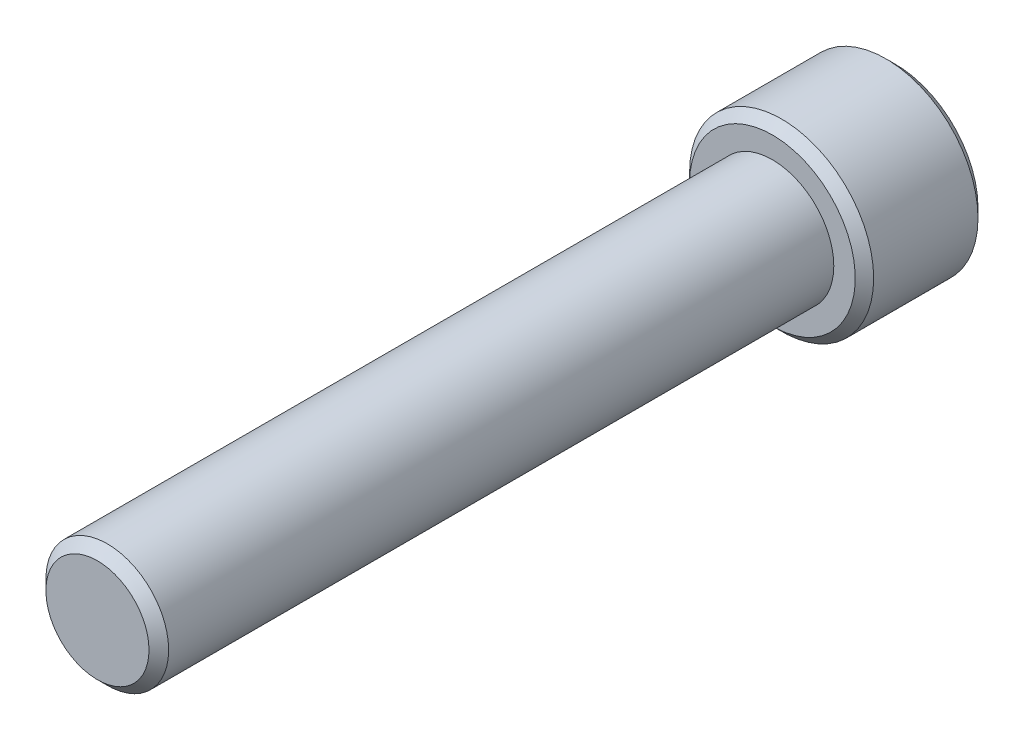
ISO-10303-21;
HEADER;
FILE_DESCRIPTION(('STEP AP214'),'2;1');
FILE_NAME('part.step','',(''),(''),'','','');
FILE_SCHEMA(('AUTOMOTIVE_DESIGN { 1 0 10303 214 1 1 1 1 }'));
ENDSEC;
DATA;
#1=APPLICATION_CONTEXT('core data for automotive mechanical design processes');
#2=APPLICATION_PROTOCOL_DEFINITION('international standard','automotive_design',2000,#1);
#3=PRODUCT_CONTEXT('',#1,'mechanical');
#4=PRODUCT('Part','Part','',(#3));
#5=PRODUCT_RELATED_PRODUCT_CATEGORY('part','',(#4));
#6=PRODUCT_DEFINITION_FORMATION('','',#4);
#7=PRODUCT_DEFINITION_CONTEXT('part definition',#1,'design');
#8=PRODUCT_DEFINITION('design','',#6,#7);
#9=PRODUCT_DEFINITION_SHAPE('','',#8);
#10=(LENGTH_UNIT() NAMED_UNIT(*) SI_UNIT(.MILLI.,.METRE.));
#11=(NAMED_UNIT(*) PLANE_ANGLE_UNIT() SI_UNIT($,.RADIAN.));
#12=(NAMED_UNIT(*) SI_UNIT($,.STERADIAN.) SOLID_ANGLE_UNIT());
#13=UNCERTAINTY_MEASURE_WITH_UNIT(LENGTH_MEASURE(1.E-05),#10,'distance_accuracy_value','');
#14=(GEOMETRIC_REPRESENTATION_CONTEXT(3) GLOBAL_UNCERTAINTY_ASSIGNED_CONTEXT((#13)) GLOBAL_UNIT_ASSIGNED_CONTEXT((#10,
#11,#12)) REPRESENTATION_CONTEXT('',''));
#15=CARTESIAN_POINT('',(0.,0.,0.));
#16=DIRECTION('',(0.,0.,1.));
#17=DIRECTION('',(1.,0.,0.));
#18=AXIS2_PLACEMENT_3D('',#15,#16,#17);
#19=CARTESIAN_POINT('',(0.,0.,-34.925));
#20=DIRECTION('',(0.,0.,1.));
#21=DIRECTION('',(1.,0.,0.));
#22=AXIS2_PLACEMENT_3D('',#19,#20,#21);
#23=CYLINDRICAL_SURFACE('',#22,3.175);
#24=CARTESIAN_POINT('',(0.,0.,-0.508000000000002));
#25=DIRECTION('',(0.,0.,1.));
#26=DIRECTION('',(1.,0.,0.));
#27=AXIS2_PLACEMENT_3D('',#24,#25,#26);
#28=CIRCLE('',#27,3.175);
#29=CARTESIAN_POINT('',(3.175,0.,-0.508000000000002));
#30=VERTEX_POINT('',#29);
#31=EDGE_CURVE('E11',#30,#30,#28,.F.);
#32=ORIENTED_EDGE('',*,*,#31,.T.);
#33=EDGE_LOOP('',(#32));
#34=FACE_BOUND('',#33,.T.);
#35=CARTESIAN_POINT('',(0.,0.,-34.925));
#36=DIRECTION('',(0.,0.,-1.));
#37=DIRECTION('',(-1.,0.,0.));
#38=AXIS2_PLACEMENT_3D('',#35,#36,#37);
#39=CIRCLE('',#38,3.175);
#40=CARTESIAN_POINT('',(-3.175,0.,-34.925));
#41=VERTEX_POINT('',#40);
#42=EDGE_CURVE('E107',#41,#41,#39,.F.);
#43=ORIENTED_EDGE('',*,*,#42,.T.);
#44=EDGE_LOOP('',(#43));
#45=FACE_BOUND('',#44,.T.);
#46=ADVANCED_FACE('F33',(#34,#45),#23,.T.);
#47=CARTESIAN_POINT('',(0.,0.,0.));
#48=DIRECTION('',(0.,0.,1.));
#49=DIRECTION('',(1.,0.,0.));
#50=AXIS2_PLACEMENT_3D('',#47,#48,#49);
#51=PLANE('',#50);
#52=CARTESIAN_POINT('',(0.,0.,0.));
#53=DIRECTION('',(0.,0.,1.));
#54=DIRECTION('',(1.,0.,0.));
#55=AXIS2_PLACEMENT_3D('',#52,#53,#54);
#56=CIRCLE('',#55,2.667);
#57=CARTESIAN_POINT('',(2.667,0.,0.));
#58=VERTEX_POINT('',#57);
#59=EDGE_CURVE('E41',#58,#58,#56,.T.);
#60=ORIENTED_EDGE('',*,*,#59,.T.);
#61=EDGE_LOOP('',(#60));
#62=FACE_BOUND('',#61,.T.);
#63=ADVANCED_FACE('F177',(#62),#51,.T.);
#64=CARTESIAN_POINT('',(0.,0.,-41.275));
#65=DIRECTION('',(0.,0.,1.));
#66=DIRECTION('',(1.,0.,0.));
#67=AXIS2_PLACEMENT_3D('',#64,#65,#66);
#68=CYLINDRICAL_SURFACE('',#67,4.7625);
#69=CARTESIAN_POINT('',(0.,0.,-40.79875));
#70=DIRECTION('',(0.,0.,-1.));
#71=DIRECTION('',(-1.,0.,0.));
#72=AXIS2_PLACEMENT_3D('',#69,#70,#71);
#73=CIRCLE('',#72,4.7625);
#74=CARTESIAN_POINT('',(4.7625,0.,-40.79875));
#75=VERTEX_POINT('',#74);
#76=EDGE_CURVE('E169',#75,#75,#73,.F.);
#77=ORIENTED_EDGE('',*,*,#76,.T.);
#78=EDGE_LOOP('',(#77));
#79=FACE_BOUND('',#78,.T.);
#80=CARTESIAN_POINT('',(0.,0.,-35.40125));
#81=DIRECTION('',(0.,0.,-1.));
#82=DIRECTION('',(-1.,0.,0.));
#83=AXIS2_PLACEMENT_3D('',#80,#81,#82);
#84=CIRCLE('',#83,4.7625);
#85=CARTESIAN_POINT('',(-4.7625,0.,-35.40125));
#86=VERTEX_POINT('',#85);
#87=EDGE_CURVE('E166',#86,#86,#84,.T.);
#88=ORIENTED_EDGE('',*,*,#87,.T.);
#89=EDGE_LOOP('',(#88));
#90=FACE_BOUND('',#89,.T.);
#91=ADVANCED_FACE('F194',(#79,#90),#68,.T.);
#92=CARTESIAN_POINT('',(0.,0.,-41.275));
#93=DIRECTION('',(0.,0.,-1.));
#94=DIRECTION('',(-1.,0.,0.));
#95=AXIS2_PLACEMENT_3D('',#92,#93,#94);
#96=PLANE('',#95);
#97=CARTESIAN_POINT('',(0.,0.,-41.275));
#98=DIRECTION('',(0.,0.,-1.));
#99=DIRECTION('',(-1.,0.,0.));
#100=AXIS2_PLACEMENT_3D('',#97,#98,#99);
#101=CIRCLE('',#100,4.28625000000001);
#102=CARTESIAN_POINT('',(4.28625000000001,0.,-41.275));
#103=VERTEX_POINT('',#102);
#104=EDGE_CURVE('E106',#103,#103,#101,.T.);
#105=ORIENTED_EDGE('',*,*,#104,.T.);
#106=EDGE_LOOP('',(#105));
#107=FACE_BOUND('',#106,.T.);
#108=CARTESIAN_POINT('',(0.,0.,-41.275));
#109=DIRECTION('',(0.,0.,-1.));
#110=DIRECTION('',(-1.,0.,0.));
#111=AXIS2_PLACEMENT_3D('',#108,#109,#110);
#112=CIRCLE('',#111,2.74963065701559);
#113=CARTESIAN_POINT('',(-2.38125,1.37481532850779,-41.275));
#114=VERTEX_POINT('',#113);
#115=CARTESIAN_POINT('',(0.,2.74963065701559,-41.275));
#116=VERTEX_POINT('',#115);
#117=EDGE_CURVE('E87',#114,#116,#112,.T.);
#118=ORIENTED_EDGE('',*,*,#117,.F.);
#119=CARTESIAN_POINT('',(-2.38125,-1.3748153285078,-41.275));
#120=VERTEX_POINT('',#119);
#121=EDGE_CURVE('E47',#120,#114,#112,.T.);
#122=ORIENTED_EDGE('',*,*,#121,.F.);
#123=CARTESIAN_POINT('',(0.,-2.74963065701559,-41.275));
#124=VERTEX_POINT('',#123);
#125=EDGE_CURVE('E401',#124,#120,#112,.T.);
#126=ORIENTED_EDGE('',*,*,#125,.F.);
#127=CARTESIAN_POINT('',(2.38125,-1.3748153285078,-41.275));
#128=VERTEX_POINT('',#127);
#129=EDGE_CURVE('E54',#128,#124,#112,.T.);
#130=ORIENTED_EDGE('',*,*,#129,.F.);
#131=CARTESIAN_POINT('',(2.38125,1.3748153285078,-41.275));
#132=VERTEX_POINT('',#131);
#133=EDGE_CURVE('E128',#132,#128,#112,.T.);
#134=ORIENTED_EDGE('',*,*,#133,.F.);
#135=EDGE_CURVE('E96',#116,#132,#112,.T.);
#136=ORIENTED_EDGE('',*,*,#135,.F.);
#137=EDGE_LOOP('',(#118,#122,#126,#130,#134,#136));
#138=FACE_BOUND('',#137,.T.);
#139=ADVANCED_FACE('F127',(#107,#138),#96,.T.);
#140=CARTESIAN_POINT('',(0.,0.,-34.925));
#141=DIRECTION('',(0.,0.,-1.));
#142=DIRECTION('',(-1.,0.,0.));
#143=AXIS2_PLACEMENT_3D('',#140,#141,#142);
#144=PLANE('',#143);
#145=CARTESIAN_POINT('',(0.,0.,-34.925));
#146=DIRECTION('',(0.,0.,-1.));
#147=DIRECTION('',(-1.,0.,0.));
#148=AXIS2_PLACEMENT_3D('',#145,#146,#147);
#149=CIRCLE('',#148,4.28625);
#150=CARTESIAN_POINT('',(-4.28625,0.,-34.925));
#151=VERTEX_POINT('',#150);
#152=EDGE_CURVE('E172',#151,#151,#149,.F.);
#153=ORIENTED_EDGE('',*,*,#152,.T.);
#154=EDGE_LOOP('',(#153));
#155=FACE_BOUND('',#154,.T.);
#156=ORIENTED_EDGE('',*,*,#42,.F.);
#157=EDGE_LOOP('',(#156));
#158=FACE_BOUND('',#157,.T.);
#159=ADVANCED_FACE('F210',(#155,#158),#144,.F.);
#160=CARTESIAN_POINT('',(0.,0.,-41.275));
#161=DIRECTION('',(0.,0.,-1.));
#162=DIRECTION('',(-1.,0.,0.));
#163=AXIS2_PLACEMENT_3D('',#160,#161,#162);
#164=CONICAL_SURFACE('',#163,2.74963065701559,0.78539816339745);
#165=ORIENTED_EDGE('',*,*,#135,.T.);
#166=CARTESIAN_POINT('',(-0.000199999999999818,2.74974612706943,-41.2751154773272));
#167=CARTESIAN_POINT('',(0.0816567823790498,2.70248609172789,-41.2278948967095));
#168=CARTESIAN_POINT('',(0.16488233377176,2.65443579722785,-41.1834475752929));
#169=CARTESIAN_POINT('',(0.33458848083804,2.556455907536,-41.1020654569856));
#170=CARTESIAN_POINT('',(0.421085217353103,2.50651699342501,-41.0651759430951));
#171=CARTESIAN_POINT('',(0.595501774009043,2.40581754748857,-41.0019834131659));
#172=CARTESIAN_POINT('',(0.683377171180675,2.35508266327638,-40.9755215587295));
#173=CARTESIAN_POINT('',(0.861062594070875,2.25249593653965,-40.9347515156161));
#174=CARTESIAN_POINT('',(0.950867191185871,2.20064722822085,-40.9204128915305));
#175=CARTESIAN_POINT('',(1.10563960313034,2.11128933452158,-40.9074757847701));
#176=CARTESIAN_POINT('',(1.17040744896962,2.07389560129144,-40.9055606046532));
#177=CARTESIAN_POINT('',(1.29983727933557,1.99916925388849,-40.9087866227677));
#178=CARTESIAN_POINT('',(1.36449921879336,1.96183666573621,-40.9139302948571));
#179=CARTESIAN_POINT('',(1.4932125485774,1.88752399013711,-40.9309813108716));
#180=CARTESIAN_POINT('',(1.55726317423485,1.85054434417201,-40.9428962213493));
#181=CARTESIAN_POINT('',(1.68425683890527,1.77722451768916,-40.972835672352));
#182=CARTESIAN_POINT('',(1.74719996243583,1.74088428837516,-40.9908597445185));
#183=CARTESIAN_POINT('',(1.90842615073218,1.64780030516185,-41.0443688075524));
#184=CARTESIAN_POINT('',(2.00570949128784,1.59163374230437,-41.0838874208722));
#185=CARTESIAN_POINT('',(2.14875606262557,1.50904576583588,-41.1506003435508));
#186=CARTESIAN_POINT('',(2.19589628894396,1.4818293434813,-41.1740402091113));
#187=CARTESIAN_POINT('',(2.28930352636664,1.42790064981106,-41.2230566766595));
#188=CARTESIAN_POINT('',(2.33557105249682,1.40118808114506,-41.2486319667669));
#189=CARTESIAN_POINT('',(2.38145,1.37469985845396,-41.2751154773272));
#190=B_SPLINE_CURVE_WITH_KNOTS('',3,(#166,#167,#168,#169,#170,#171,#172,#173,#174,#175,#176,
#177,#178,#179,#180,#181,#182,#183,#184,#185,#186,#187,#188,#189),.UNSPECIFIED.,.F.,.F.,(4,2,2,
2,2,2,2,2,2,2,2,4),(0.,0.317196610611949,0.636241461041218,0.950218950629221,1.26340583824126,
1.48752413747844,1.71172100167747,1.93616888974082,2.16059957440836,2.51709639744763,
2.69486147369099,2.87251813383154),.UNSPECIFIED.);
#191=EDGE_CURVE('E101',#116,#132,#190,.T.);
#192=ORIENTED_EDGE('',*,*,#191,.F.);
#193=EDGE_LOOP('',(#165,#192));
#194=FACE_BOUND('',#193,.T.);
#195=ADVANCED_FACE('F102',(#194),#164,.F.);
#196=ORIENTED_EDGE('',*,*,#133,.T.);
#197=CARTESIAN_POINT('',(2.38125,-2.74194290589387,-42.1569808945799));
#198=CARTESIAN_POINT('',(2.38125,-2.6751796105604,-42.1065846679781));
#199=CARTESIAN_POINT('',(2.38125,-2.60804251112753,-42.0566755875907));
#200=CARTESIAN_POINT('',(2.38125,-2.47287325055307,-41.9580498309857));
#201=CARTESIAN_POINT('',(2.38125,-2.40484086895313,-41.9093334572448));
#202=CARTESIAN_POINT('',(2.38125,-2.26723593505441,-41.8129648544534));
#203=CARTESIAN_POINT('',(2.38125,-2.1976555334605,-41.7653237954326));
#204=CARTESIAN_POINT('',(2.38125,-2.05731367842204,-41.6718199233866));
#205=CARTESIAN_POINT('',(2.38125,-1.98655230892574,-41.6259569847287));
#206=CARTESIAN_POINT('',(2.38125,-1.83957751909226,-41.5338459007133));
#207=CARTESIAN_POINT('',(2.38125,-1.76328361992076,-41.4877255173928));
#208=CARTESIAN_POINT('',(2.38125,-1.6089135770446,-41.3985183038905));
#209=CARTESIAN_POINT('',(2.38125,-1.53083712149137,-41.3554320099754));
#210=CARTESIAN_POINT('',(2.38125,-1.37291620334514,-41.2732265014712));
#211=CARTESIAN_POINT('',(2.38125,-1.29307799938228,-41.2340953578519));
#212=CARTESIAN_POINT('',(2.38125,-1.13121425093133,-41.1606679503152));
#213=CARTESIAN_POINT('',(2.38125,-1.04918943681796,-41.1263700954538));
#214=CARTESIAN_POINT('',(2.38125,-0.889535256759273,-41.0663546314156));
#215=CARTESIAN_POINT('',(2.38125,-0.812083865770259,-41.040168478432));
#216=CARTESIAN_POINT('',(2.38125,-0.655316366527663,-40.9940097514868));
#217=CARTESIAN_POINT('',(2.38125,-0.576000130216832,-40.9740376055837));
#218=CARTESIAN_POINT('',(2.38125,-0.417295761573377,-40.9416821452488));
#219=CARTESIAN_POINT('',(2.38125,-0.337934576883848,-40.9291688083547));
#220=CARTESIAN_POINT('',(2.38125,-0.178363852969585,-40.9119738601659));
#221=CARTESIAN_POINT('',(2.38125,-0.098154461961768,-40.9072909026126));
#222=CARTESIAN_POINT('',(2.38125,0.0594188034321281,-40.9061044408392));
#223=CARTESIAN_POINT('',(2.38125,0.136780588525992,-40.9093110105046));
#224=CARTESIAN_POINT('',(2.38125,0.290840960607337,-40.9230870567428));
#225=CARTESIAN_POINT('',(2.38125,0.367539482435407,-40.9336572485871));
#226=CARTESIAN_POINT('',(2.38125,0.521017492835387,-40.9617628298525));
#227=CARTESIAN_POINT('',(2.38125,0.597774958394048,-40.9794167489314));
#228=CARTESIAN_POINT('',(2.38125,0.749609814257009,-41.0207513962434));
#229=CARTESIAN_POINT('',(2.38125,0.824687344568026,-41.0444316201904));
#230=CARTESIAN_POINT('',(2.38125,1.06107814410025,-41.127894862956));
#231=CARTESIAN_POINT('',(2.38125,1.21904786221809,-41.1971839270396));
#232=CARTESIAN_POINT('',(2.38125,1.45021000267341,-41.3126640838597));
#233=CARTESIAN_POINT('',(2.38125,1.52644290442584,-41.3531730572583));
#234=CARTESIAN_POINT('',(2.38125,1.67717618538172,-41.4373026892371));
#235=CARTESIAN_POINT('',(2.38125,1.75167687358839,-41.4809227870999));
#236=CARTESIAN_POINT('',(2.38125,1.89548152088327,-41.568412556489));
#237=CARTESIAN_POINT('',(2.38125,1.96485959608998,-41.6121617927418));
#238=CARTESIAN_POINT('',(2.38125,2.10242624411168,-41.7015011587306));
#239=CARTESIAN_POINT('',(2.38125,2.17061472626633,-41.747091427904));
#240=CARTESIAN_POINT('',(2.38125,2.30540317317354,-41.8394060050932));
#241=CARTESIAN_POINT('',(2.38125,2.37201154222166,-41.8861180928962));
#242=CARTESIAN_POINT('',(2.38125,2.50431800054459,-41.9807775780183));
#243=CARTESIAN_POINT('',(2.38125,2.57001633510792,-42.0287246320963));
#244=CARTESIAN_POINT('',(2.38125,2.63533378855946,-42.0771767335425));
#245=B_SPLINE_CURVE_WITH_KNOTS('',3,(#197,#198,#199,#200,#201,#202,#203,#204,#205,#206,#207,
#208,#209,#210,#211,#212,#213,#214,#215,#216,#217,#218,#219,#220,#221,#222,#223,#224,#225,#226,
#227,#228,#229,#230,#231,#232,#233,#234,#235,#236,#237,#238,#239,#240,#241,#242,#243,#244),
.UNSPECIFIED.,.F.,.F.,(4,2,2,2,2,2,2,2,2,2,2,2,2,2,2,2,2,2,2,2,2,2,2,4),(0.,0.250951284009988,
0.501965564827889,0.754924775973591,1.00786608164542,1.27526207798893,1.54270521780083,
1.80931602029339,2.0758388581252,2.32089852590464,2.56597507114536,2.80664400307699,
3.04727155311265,3.27918940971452,3.51112979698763,3.74712477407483,3.98310000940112,
4.49898139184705,4.75794323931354,5.01685853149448,5.26288960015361,5.50893933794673,
5.75299038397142,5.99697431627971),.UNSPECIFIED.);
#246=EDGE_CURVE('E95',#132,#128,#245,.F.);
#247=ORIENTED_EDGE('',*,*,#246,.F.);
#248=EDGE_LOOP('',(#196,#247));
#249=FACE_BOUND('',#248,.T.);
#250=ADVANCED_FACE('F277',(#249),#164,.F.);
#251=ORIENTED_EDGE('',*,*,#129,.T.);
#252=CARTESIAN_POINT('',(2.38145,-1.37469985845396,-41.2751154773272));
#253=CARTESIAN_POINT('',(2.29959321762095,-1.4219598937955,-41.2278948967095));
#254=CARTESIAN_POINT('',(2.21636766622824,-1.47001018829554,-41.1834475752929));
#255=CARTESIAN_POINT('',(2.04666151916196,-1.56799007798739,-41.1020654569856));
#256=CARTESIAN_POINT('',(1.9601647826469,-1.61792899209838,-41.0651759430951));
#257=CARTESIAN_POINT('',(1.78574822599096,-1.71862843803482,-41.0019834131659));
#258=CARTESIAN_POINT('',(1.69787282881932,-1.76936332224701,-40.9755215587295));
#259=CARTESIAN_POINT('',(1.52018740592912,-1.87195004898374,-40.9347515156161));
#260=CARTESIAN_POINT('',(1.43038280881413,-1.92379875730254,-40.9204128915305));
#261=CARTESIAN_POINT('',(1.27561039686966,-2.01315665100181,-40.9074757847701));
#262=CARTESIAN_POINT('',(1.21084255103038,-2.05055038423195,-40.9055606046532));
#263=CARTESIAN_POINT('',(1.08141272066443,-2.1252767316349,-40.9087866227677));
#264=CARTESIAN_POINT('',(1.01675078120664,-2.16260931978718,-40.9139302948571));
#265=CARTESIAN_POINT('',(0.888037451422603,-2.23692199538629,-40.9309813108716));
#266=CARTESIAN_POINT('',(0.823986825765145,-2.27390164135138,-40.9428962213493));
#267=CARTESIAN_POINT('',(0.696993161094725,-2.34722146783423,-40.972835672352));
#268=CARTESIAN_POINT('',(0.634050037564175,-2.38356169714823,-40.9908597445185));
#269=CARTESIAN_POINT('',(0.472823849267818,-2.47664568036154,-41.0443688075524));
#270=CARTESIAN_POINT('',(0.37554050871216,-2.53281224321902,-41.0838874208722));
#271=CARTESIAN_POINT('',(0.232493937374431,-2.61540021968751,-41.1506003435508));
#272=CARTESIAN_POINT('',(0.185353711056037,-2.64261664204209,-41.1740402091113));
#273=CARTESIAN_POINT('',(0.0919464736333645,-2.69654533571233,-41.2230566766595));
#274=CARTESIAN_POINT('',(0.0456789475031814,-2.72325790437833,-41.2486319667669));
#275=CARTESIAN_POINT('',(-0.000199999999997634,-2.74974612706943,-41.2751154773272));
#276=B_SPLINE_CURVE_WITH_KNOTS('',3,(#252,#253,#254,#255,#256,#257,#258,#259,#260,#261,#262,
#263,#264,#265,#266,#267,#268,#269,#270,#271,#272,#273,#274,#275),.UNSPECIFIED.,.F.,.F.,(4,2,2,
2,2,2,2,2,2,2,2,4),(0.,0.317196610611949,0.636241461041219,0.950218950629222,1.26340583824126,
1.48752413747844,1.71172100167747,1.93616888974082,2.16059957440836,2.51709639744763,
2.69486147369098,2.87251813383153),.UNSPECIFIED.);
#277=EDGE_CURVE('E137',#128,#124,#276,.T.);
#278=ORIENTED_EDGE('',*,*,#277,.F.);
#279=EDGE_LOOP('',(#251,#278));
#280=FACE_BOUND('',#279,.T.);
#281=ADVANCED_FACE('F269',(#280),#164,.F.);
#282=ORIENTED_EDGE('',*,*,#125,.T.);
#283=CARTESIAN_POINT('',(0.00020000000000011,-2.74974612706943,-41.2751154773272));
#284=CARTESIAN_POINT('',(-0.0816567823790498,-2.70248609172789,-41.2278948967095));
#285=CARTESIAN_POINT('',(-0.16488233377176,-2.65443579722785,-41.1834475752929));
#286=CARTESIAN_POINT('',(-0.33458848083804,-2.556455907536,-41.1020654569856));
#287=CARTESIAN_POINT('',(-0.421085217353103,-2.50651699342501,-41.0651759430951));
#288=CARTESIAN_POINT('',(-0.595501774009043,-2.40581754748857,-41.0019834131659));
#289=CARTESIAN_POINT('',(-0.683377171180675,-2.35508266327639,-40.9755215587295));
#290=CARTESIAN_POINT('',(-0.861062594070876,-2.25249593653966,-40.9347515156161));
#291=CARTESIAN_POINT('',(-0.950867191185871,-2.20064722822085,-40.9204128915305));
#292=CARTESIAN_POINT('',(-1.10563960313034,-2.11128933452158,-40.9074757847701));
#293=CARTESIAN_POINT('',(-1.17040744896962,-2.07389560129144,-40.9055606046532));
#294=CARTESIAN_POINT('',(-1.29983727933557,-1.99916925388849,-40.9087866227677));
#295=CARTESIAN_POINT('',(-1.36449921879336,-1.96183666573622,-40.9139302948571));
#296=CARTESIAN_POINT('',(-1.4932125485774,-1.88752399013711,-40.9309813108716));
#297=CARTESIAN_POINT('',(-1.55726317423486,-1.85054434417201,-40.9428962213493));
#298=CARTESIAN_POINT('',(-1.68425683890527,-1.77722451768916,-40.972835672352));
#299=CARTESIAN_POINT('',(-1.74719996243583,-1.74088428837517,-40.9908597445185));
#300=CARTESIAN_POINT('',(-1.90842615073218,-1.64780030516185,-41.0443688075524));
#301=CARTESIAN_POINT('',(-2.00570949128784,-1.59163374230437,-41.0838874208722));
#302=CARTESIAN_POINT('',(-2.14875606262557,-1.50904576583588,-41.1506003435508));
#303=CARTESIAN_POINT('',(-2.19589628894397,-1.48182934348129,-41.1740402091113));
#304=CARTESIAN_POINT('',(-2.28930352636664,-1.42790064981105,-41.2230566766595));
#305=CARTESIAN_POINT('',(-2.33557105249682,-1.40118808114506,-41.2486319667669));
#306=CARTESIAN_POINT('',(-2.38145,-1.37469985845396,-41.2751154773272));
#307=B_SPLINE_CURVE_WITH_KNOTS('',3,(#283,#284,#285,#286,#287,#288,#289,#290,#291,#292,#293,
#294,#295,#296,#297,#298,#299,#300,#301,#302,#303,#304,#305,#306),.UNSPECIFIED.,.F.,.F.,(4,2,2,
2,2,2,2,2,2,2,2,4),(0.,0.317196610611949,0.636241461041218,0.950218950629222,1.26340583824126,
1.48752413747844,1.71172100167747,1.93616888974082,2.16059957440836,2.51709639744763,
2.69486147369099,2.87251813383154),.UNSPECIFIED.);
#308=EDGE_CURVE('E364',#124,#120,#307,.T.);
#309=ORIENTED_EDGE('',*,*,#308,.F.);
#310=EDGE_LOOP('',(#282,#309));
#311=FACE_BOUND('',#310,.T.);
#312=ADVANCED_FACE('F262',(#311),#164,.F.);
#313=ORIENTED_EDGE('',*,*,#121,.T.);
#314=CARTESIAN_POINT('',(-2.38125,-2.7419429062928,-42.1569808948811));
#315=CARTESIAN_POINT('',(-2.38125,-2.67517961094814,-42.1065846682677));
#316=CARTESIAN_POINT('',(-2.38125,-2.60804251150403,-42.0566755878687));
#317=CARTESIAN_POINT('',(-2.38125,-2.47287325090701,-41.9580498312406));
#318=CARTESIAN_POINT('',(-2.38125,-2.40484086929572,-41.9093334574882));
#319=CARTESIAN_POINT('',(-2.38125,-2.26723593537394,-41.8129648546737));
#320=CARTESIAN_POINT('',(-2.38125,-2.1976555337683,-41.7653237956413));
#321=CARTESIAN_POINT('',(-2.38125,-2.05731367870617,-41.6718199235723));
#322=CARTESIAN_POINT('',(-2.38125,-1.98655230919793,-41.625956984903));
#323=CARTESIAN_POINT('',(-2.38125,-1.83957751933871,-41.5338459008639));
#324=CARTESIAN_POINT('',(-2.38125,-1.76328362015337,-41.4877255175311));
#325=CARTESIAN_POINT('',(-2.38125,-1.60891357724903,-41.3985183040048));
#326=CARTESIAN_POINT('',(-2.38125,-1.53083712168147,-41.355432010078));
#327=CARTESIAN_POINT('',(-2.38125,-1.37291620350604,-41.2732265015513));
#328=CARTESIAN_POINT('',(-2.38125,-1.29307799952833,-41.2340953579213));
#329=CARTESIAN_POINT('',(-2.38125,-1.13121425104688,-41.1606679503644));
#330=CARTESIAN_POINT('',(-2.38125,-1.04918943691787,-41.1263700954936));
#331=CARTESIAN_POINT('',(-2.38125,-0.889535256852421,-41.0663546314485));
#332=CARTESIAN_POINT('',(-2.38125,-0.81208386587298,-41.0401684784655));
#333=CARTESIAN_POINT('',(-2.38125,-0.65531636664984,-40.9940097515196));
#334=CARTESIAN_POINT('',(-2.38125,-0.576000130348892,-40.9740376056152));
#335=CARTESIAN_POINT('',(-2.38125,-0.417295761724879,-40.9416821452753));
#336=CARTESIAN_POINT('',(-2.38125,-0.337934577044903,-40.9291688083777));
#337=CARTESIAN_POINT('',(-2.38125,-0.178363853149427,-40.9119738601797));
#338=CARTESIAN_POINT('',(-2.38125,-0.0981544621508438,-40.9072909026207));
#339=CARTESIAN_POINT('',(-2.38125,0.0594188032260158,-40.9061044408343));
#340=CARTESIAN_POINT('',(-2.38125,0.136780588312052,-40.9093110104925));
#341=CARTESIAN_POINT('',(-2.38125,0.290840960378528,-40.9230870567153));
#342=CARTESIAN_POINT('',(-2.38125,0.367539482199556,-40.9336572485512));
#343=CARTESIAN_POINT('',(-2.38125,0.521017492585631,-40.9617628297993));
#344=CARTESIAN_POINT('',(-2.38125,0.597774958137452,-40.9794167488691));
#345=CARTESIAN_POINT('',(-2.38125,0.749609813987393,-41.0207513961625));
#346=CARTESIAN_POINT('',(-2.38125,0.82468734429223,-41.0444316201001));
#347=CARTESIAN_POINT('',(-2.38125,1.0610781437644,-41.1278948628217));
#348=CARTESIAN_POINT('',(-2.38125,1.21904786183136,-41.1971839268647));
#349=CARTESIAN_POINT('',(-2.38125,1.45021000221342,-41.3126640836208));
#350=CARTESIAN_POINT('',(-2.38125,1.52644290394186,-41.3531730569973));
#351=CARTESIAN_POINT('',(-2.38125,1.67717618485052,-41.4373026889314));
#352=CARTESIAN_POINT('',(-2.38125,1.75167687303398,-41.4809227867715));
#353=CARTESIAN_POINT('',(-2.38125,1.89548152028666,-41.5684125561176));
#354=CARTESIAN_POINT('',(-2.38125,1.96485959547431,-41.61216179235));
#355=CARTESIAN_POINT('',(-2.38125,2.10242624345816,-41.7015011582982));
#356=CARTESIAN_POINT('',(-2.38125,2.17061472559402,-41.7470914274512));
#357=CARTESIAN_POINT('',(-2.38125,2.30540317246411,-41.8394060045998));
#358=CARTESIAN_POINT('',(-2.38125,2.3720115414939,-41.8861180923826));
#359=CARTESIAN_POINT('',(-2.38125,2.50431799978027,-41.9807775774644));
#360=CARTESIAN_POINT('',(-2.38125,2.57001633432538,-42.0287246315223));
#361=CARTESIAN_POINT('',(-2.38125,2.63533378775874,-42.0771767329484));
#362=B_SPLINE_CURVE_WITH_KNOTS('',3,(#314,#315,#316,#317,#318,#319,#320,#321,#322,#323,#324,
#325,#326,#327,#328,#329,#330,#331,#332,#333,#334,#335,#336,#337,#338,#339,#340,#341,#342,#343,
#344,#345,#346,#347,#348,#349,#350,#351,#352,#353,#354,#355,#356,#357,#358,#359,#360,#361),
.UNSPECIFIED.,.F.,.F.,(4,2,2,2,2,2,2,2,2,2,2,2,2,2,2,2,2,2,2,2,2,2,2,4),(0.,0.250951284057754,
0.501965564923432,0.754924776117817,1.00786608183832,1.2752620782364,1.54270521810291,
1.80931602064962,2.07583885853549,2.32089852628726,2.56597507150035,2.80664400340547,
3.04727155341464,3.27918940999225,3.51112979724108,3.74712477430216,3.98310000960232,
4.49898139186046,4.75794323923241,5.01685853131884,5.26288959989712,5.50893933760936,
5.75299038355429,5.99697431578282),.UNSPECIFIED.);
#363=EDGE_CURVE('E117',#120,#114,#362,.T.);
#364=ORIENTED_EDGE('',*,*,#363,.F.);
#365=EDGE_LOOP('',(#313,#364));
#366=FACE_BOUND('',#365,.T.);
#367=ADVANCED_FACE('F254',(#366),#164,.F.);
#368=ORIENTED_EDGE('',*,*,#117,.T.);
#369=CARTESIAN_POINT('',(-2.38145,1.37469985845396,-41.2751154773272));
#370=CARTESIAN_POINT('',(-2.29959321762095,1.4219598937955,-41.2278948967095));
#371=CARTESIAN_POINT('',(-2.21636766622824,1.47001018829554,-41.1834475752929));
#372=CARTESIAN_POINT('',(-2.04666151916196,1.56799007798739,-41.1020654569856));
#373=CARTESIAN_POINT('',(-1.9601647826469,1.61792899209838,-41.0651759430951));
#374=CARTESIAN_POINT('',(-1.78574822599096,1.71862843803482,-41.0019834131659));
#375=CARTESIAN_POINT('',(-1.69787282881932,1.769363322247,-40.9755215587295));
#376=CARTESIAN_POINT('',(-1.52018740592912,1.87195004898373,-40.9347515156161));
#377=CARTESIAN_POINT('',(-1.43038280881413,1.92379875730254,-40.9204128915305));
#378=CARTESIAN_POINT('',(-1.27561039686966,2.01315665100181,-40.9074757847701));
#379=CARTESIAN_POINT('',(-1.21084255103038,2.05055038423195,-40.9055606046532));
#380=CARTESIAN_POINT('',(-1.08141272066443,2.1252767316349,-40.9087866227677));
#381=CARTESIAN_POINT('',(-1.01675078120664,2.16260931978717,-40.9139302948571));
#382=CARTESIAN_POINT('',(-0.888037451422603,2.23692199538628,-40.9309813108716));
#383=CARTESIAN_POINT('',(-0.823986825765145,2.27390164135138,-40.9428962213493));
#384=CARTESIAN_POINT('',(-0.696993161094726,2.34722146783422,-40.972835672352));
#385=CARTESIAN_POINT('',(-0.634050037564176,2.38356169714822,-40.9908597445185));
#386=CARTESIAN_POINT('',(-0.472823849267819,2.47664568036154,-41.0443688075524));
#387=CARTESIAN_POINT('',(-0.37554050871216,2.53281224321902,-41.0838874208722));
#388=CARTESIAN_POINT('',(-0.23249393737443,2.61540021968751,-41.1506003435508));
#389=CARTESIAN_POINT('',(-0.185353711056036,2.64261664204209,-41.1740402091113));
#390=CARTESIAN_POINT('',(-0.0919464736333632,2.69654533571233,-41.2230566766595));
#391=CARTESIAN_POINT('',(-0.0456789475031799,2.72325790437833,-41.2486319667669));
#392=CARTESIAN_POINT('',(0.000199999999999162,2.74974612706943,-41.2751154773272));
#393=B_SPLINE_CURVE_WITH_KNOTS('',3,(#369,#370,#371,#372,#373,#374,#375,#376,#377,#378,#379,
#380,#381,#382,#383,#384,#385,#386,#387,#388,#389,#390,#391,#392),.UNSPECIFIED.,.F.,.F.,(4,2,2,
2,2,2,2,2,2,2,2,4),(0.,0.317196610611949,0.636241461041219,0.950218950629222,1.26340583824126,
1.48752413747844,1.71172100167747,1.93616888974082,2.16059957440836,2.51709639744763,
2.69486147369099,2.87251813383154),.UNSPECIFIED.);
#394=EDGE_CURVE('E91',#114,#116,#393,.T.);
#395=ORIENTED_EDGE('',*,*,#394,.F.);
#396=EDGE_LOOP('',(#368,#395));
#397=FACE_BOUND('',#396,.T.);
#398=ADVANCED_FACE('F89',(#397),#164,.F.);
#399=CARTESIAN_POINT('',(2.38125,4.12444598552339,-37.703125));
#400=DIRECTION('',(0.,0.,-1.));
#401=DIRECTION('',(-1.,0.,0.));
#402=AXIS2_PLACEMENT_3D('',#399,#400,#401);
#403=PLANE('',#402);
#404=DIRECTION('',(0.866025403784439,0.5,0.));
#405=VECTOR('',#404,1.);
#406=CARTESIAN_POINT('',(-2.38125,1.3748153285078,-37.703125));
#407=LINE('',#406,#405);
#408=CARTESIAN_POINT('',(-2.38125,1.3748153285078,-37.703125));
#409=VERTEX_POINT('',#408);
#410=CARTESIAN_POINT('',(0.,2.74963065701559,-37.703125));
#411=VERTEX_POINT('',#410);
#412=EDGE_CURVE('E116',#409,#411,#407,.T.);
#413=ORIENTED_EDGE('',*,*,#412,.T.);
#414=DIRECTION('',(0.866025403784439,-0.5,0.));
#415=VECTOR('',#414,1.);
#416=CARTESIAN_POINT('',(0.,2.74963065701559,-37.703125));
#417=LINE('',#416,#415);
#418=CARTESIAN_POINT('',(2.38125,1.3748153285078,-37.703125));
#419=VERTEX_POINT('',#418);
#420=EDGE_CURVE('E121',#411,#419,#417,.T.);
#421=ORIENTED_EDGE('',*,*,#420,.T.);
#422=DIRECTION('',(0.,-1.,0.));
#423=VECTOR('',#422,1.);
#424=CARTESIAN_POINT('',(2.38125,1.3748153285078,-37.703125));
#425=LINE('',#424,#423);
#426=CARTESIAN_POINT('',(2.38125,-1.3748153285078,-37.703125));
#427=VERTEX_POINT('',#426);
#428=EDGE_CURVE('E374',#419,#427,#425,.T.);
#429=ORIENTED_EDGE('',*,*,#428,.T.);
#430=DIRECTION('',(-0.866025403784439,-0.5,0.));
#431=VECTOR('',#430,1.);
#432=CARTESIAN_POINT('',(2.38125,-1.3748153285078,-37.703125));
#433=LINE('',#432,#431);
#434=CARTESIAN_POINT('',(0.,-2.74963065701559,-37.703125));
#435=VERTEX_POINT('',#434);
#436=EDGE_CURVE('E377',#427,#435,#433,.T.);
#437=ORIENTED_EDGE('',*,*,#436,.T.);
#438=DIRECTION('',(-0.866025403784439,0.5,0.));
#439=VECTOR('',#438,1.);
#440=CARTESIAN_POINT('',(0.,-2.74963065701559,-37.703125));
#441=LINE('',#440,#439);
#442=CARTESIAN_POINT('',(-2.38125,-1.3748153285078,-37.703125));
#443=VERTEX_POINT('',#442);
#444=EDGE_CURVE('E380',#435,#443,#441,.T.);
#445=ORIENTED_EDGE('',*,*,#444,.T.);
#446=DIRECTION('',(0.,1.,0.));
#447=VECTOR('',#446,1.);
#448=CARTESIAN_POINT('',(-2.38125,-1.3748153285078,-37.703125));
#449=LINE('',#448,#447);
#450=EDGE_CURVE('E124',#443,#409,#449,.T.);
#451=ORIENTED_EDGE('',*,*,#450,.T.);
#452=EDGE_LOOP('',(#413,#421,#429,#437,#445,#451));
#453=FACE_BOUND('',#452,.T.);
#454=ADVANCED_FACE('F156',(#453),#403,.T.);
#455=CARTESIAN_POINT('',(0.,2.74963065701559,-37.703125));
#456=DIRECTION('',(0.5,0.866025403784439,0.));
#457=DIRECTION('',(-0.866025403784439,0.5,0.));
#458=AXIS2_PLACEMENT_3D('',#455,#456,#457);
#459=PLANE('',#458);
#460=DIRECTION('',(0.,0.,-1.));
#461=VECTOR('',#460,1.);
#462=CARTESIAN_POINT('',(0.,2.74963065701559,-37.703125));
#463=LINE('',#462,#461);
#464=EDGE_CURVE('E113',#411,#116,#463,.T.);
#465=ORIENTED_EDGE('',*,*,#464,.T.);
#466=ORIENTED_EDGE('',*,*,#191,.T.);
#467=DIRECTION('',(0.,0.,-1.));
#468=VECTOR('',#467,1.);
#469=CARTESIAN_POINT('',(2.38125,1.3748153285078,-37.703125));
#470=LINE('',#469,#468);
#471=EDGE_CURVE('E123',#419,#132,#470,.T.);
#472=ORIENTED_EDGE('',*,*,#471,.F.);
#473=ORIENTED_EDGE('',*,*,#420,.F.);
#474=EDGE_LOOP('',(#465,#466,#472,#473));
#475=FACE_BOUND('',#474,.T.);
#476=ADVANCED_FACE('F119',(#475),#459,.F.);
#477=CARTESIAN_POINT('',(2.38125,1.3748153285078,-37.703125));
#478=DIRECTION('',(1.,0.,0.));
#479=DIRECTION('',(0.,0.,-1.));
#480=AXIS2_PLACEMENT_3D('',#477,#478,#479);
#481=PLANE('',#480);
#482=ORIENTED_EDGE('',*,*,#471,.T.);
#483=ORIENTED_EDGE('',*,*,#246,.T.);
#484=DIRECTION('',(0.,0.,-1.));
#485=VECTOR('',#484,1.);
#486=CARTESIAN_POINT('',(2.38125,-1.3748153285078,-37.703125));
#487=LINE('',#486,#485);
#488=EDGE_CURVE('E391',#427,#128,#487,.T.);
#489=ORIENTED_EDGE('',*,*,#488,.F.);
#490=ORIENTED_EDGE('',*,*,#428,.F.);
#491=EDGE_LOOP('',(#482,#483,#489,#490));
#492=FACE_BOUND('',#491,.T.);
#493=ADVANCED_FACE('F145',(#492),#481,.F.);
#494=CARTESIAN_POINT('',(2.38125,-1.3748153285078,-37.703125));
#495=DIRECTION('',(0.5,-0.866025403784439,0.));
#496=DIRECTION('',(0.866025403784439,0.5,0.));
#497=AXIS2_PLACEMENT_3D('',#494,#495,#496);
#498=PLANE('',#497);
#499=ORIENTED_EDGE('',*,*,#488,.T.);
#500=ORIENTED_EDGE('',*,*,#277,.T.);
#501=DIRECTION('',(0.,0.,-1.));
#502=VECTOR('',#501,1.);
#503=CARTESIAN_POINT('',(0.,-2.74963065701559,-37.703125));
#504=LINE('',#503,#502);
#505=EDGE_CURVE('E388',#435,#124,#504,.T.);
#506=ORIENTED_EDGE('',*,*,#505,.F.);
#507=ORIENTED_EDGE('',*,*,#436,.F.);
#508=EDGE_LOOP('',(#499,#500,#506,#507));
#509=FACE_BOUND('',#508,.T.);
#510=ADVANCED_FACE('F149',(#509),#498,.F.);
#511=CARTESIAN_POINT('',(0.,-2.74963065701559,-37.703125));
#512=DIRECTION('',(-0.5,-0.866025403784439,0.));
#513=DIRECTION('',(0.866025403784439,-0.5,0.));
#514=AXIS2_PLACEMENT_3D('',#511,#512,#513);
#515=PLANE('',#514);
#516=ORIENTED_EDGE('',*,*,#505,.T.);
#517=ORIENTED_EDGE('',*,*,#308,.T.);
#518=DIRECTION('',(0.,0.,-1.));
#519=VECTOR('',#518,1.);
#520=CARTESIAN_POINT('',(-2.38125,-1.3748153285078,-37.703125));
#521=LINE('',#520,#519);
#522=EDGE_CURVE('E386',#443,#120,#521,.T.);
#523=ORIENTED_EDGE('',*,*,#522,.F.);
#524=ORIENTED_EDGE('',*,*,#444,.F.);
#525=EDGE_LOOP('',(#516,#517,#523,#524));
#526=FACE_BOUND('',#525,.T.);
#527=ADVANCED_FACE('F313',(#526),#515,.F.);
#528=CARTESIAN_POINT('',(-2.38125,-1.3748153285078,-37.703125));
#529=DIRECTION('',(-1.,0.,0.));
#530=DIRECTION('',(0.,-1.,0.));
#531=AXIS2_PLACEMENT_3D('',#528,#529,#530);
#532=PLANE('',#531);
#533=ORIENTED_EDGE('',*,*,#522,.T.);
#534=ORIENTED_EDGE('',*,*,#363,.T.);
#535=DIRECTION('',(0.,0.,-1.));
#536=VECTOR('',#535,1.);
#537=CARTESIAN_POINT('',(-2.38125,1.3748153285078,-37.703125));
#538=LINE('',#537,#536);
#539=EDGE_CURVE('E115',#409,#114,#538,.T.);
#540=ORIENTED_EDGE('',*,*,#539,.F.);
#541=ORIENTED_EDGE('',*,*,#450,.F.);
#542=EDGE_LOOP('',(#533,#534,#540,#541));
#543=FACE_BOUND('',#542,.T.);
#544=ADVANCED_FACE('F204',(#543),#532,.F.);
#545=CARTESIAN_POINT('',(-2.38125,1.3748153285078,-37.703125));
#546=DIRECTION('',(-0.5,0.866025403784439,0.));
#547=DIRECTION('',(-0.866025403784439,-0.5,0.));
#548=AXIS2_PLACEMENT_3D('',#545,#546,#547);
#549=PLANE('',#548);
#550=ORIENTED_EDGE('',*,*,#539,.T.);
#551=ORIENTED_EDGE('',*,*,#394,.T.);
#552=ORIENTED_EDGE('',*,*,#464,.F.);
#553=ORIENTED_EDGE('',*,*,#412,.F.);
#554=EDGE_LOOP('',(#550,#551,#552,#553));
#555=FACE_BOUND('',#554,.T.);
#556=ADVANCED_FACE('F111',(#555),#549,.F.);
#557=CARTESIAN_POINT('',(0.,0.,-41.275));
#558=DIRECTION('',(0.,0.,1.));
#559=DIRECTION('',(1.,0.,0.));
#560=AXIS2_PLACEMENT_3D('',#557,#558,#559);
#561=CONICAL_SURFACE('',#560,4.28625000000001,0.785398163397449);
#562=CARTESIAN_POINT('',(4.7625,0.,-40.79875));
#563=CARTESIAN_POINT('',(4.7575390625,0.,-40.8037109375));
#564=CARTESIAN_POINT('',(4.752578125,0.,-40.808671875));
#565=CARTESIAN_POINT('',(4.74265625,0.,-40.81859375));
#566=CARTESIAN_POINT('',(4.7376953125,0.,-40.8235546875));
#567=CARTESIAN_POINT('',(4.7277734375,0.,-40.8334765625));
#568=CARTESIAN_POINT('',(4.72281250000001,0.,-40.8384375));
#569=CARTESIAN_POINT('',(4.712890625,0.,-40.848359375));
#570=CARTESIAN_POINT('',(4.7079296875,0.,-40.8533203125));
#571=CARTESIAN_POINT('',(4.69800781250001,0.,-40.8632421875));
#572=CARTESIAN_POINT('',(4.69304687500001,0.,-40.868203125));
#573=CARTESIAN_POINT('',(4.683125,0.,-40.878125));
#574=CARTESIAN_POINT('',(4.6781640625,0.,-40.8830859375));
#575=CARTESIAN_POINT('',(4.6682421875,0.,-40.8930078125));
#576=CARTESIAN_POINT('',(4.66328125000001,0.,-40.89796875));
#577=CARTESIAN_POINT('',(4.65335937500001,0.,-40.907890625));
#578=CARTESIAN_POINT('',(4.64839843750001,0.,-40.9128515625));
#579=CARTESIAN_POINT('',(4.63847656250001,0.,-40.9227734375));
#580=CARTESIAN_POINT('',(4.63351562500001,0.,-40.927734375));
#581=CARTESIAN_POINT('',(4.62359375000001,0.,-40.93765625));
#582=CARTESIAN_POINT('',(4.61863281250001,0.,-40.9426171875));
#583=CARTESIAN_POINT('',(4.60871093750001,0.,-40.9525390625));
#584=CARTESIAN_POINT('',(4.60375000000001,0.,-40.9575));
#585=CARTESIAN_POINT('',(4.59382812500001,0.,-40.967421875));
#586=CARTESIAN_POINT('',(4.58886718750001,0.,-40.9723828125));
#587=CARTESIAN_POINT('',(4.57894531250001,0.,-40.9823046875));
#588=CARTESIAN_POINT('',(4.57398437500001,0.,-40.987265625));
#589=CARTESIAN_POINT('',(4.56406250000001,0.,-40.9971875));
#590=CARTESIAN_POINT('',(4.55910156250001,0.,-41.0021484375));
#591=CARTESIAN_POINT('',(4.54917968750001,0.,-41.0120703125));
#592=CARTESIAN_POINT('',(4.54421875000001,0.,-41.01703125));
#593=CARTESIAN_POINT('',(4.53429687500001,0.,-41.026953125));
#594=CARTESIAN_POINT('',(4.52933593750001,0.,-41.0319140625));
#595=CARTESIAN_POINT('',(4.51941406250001,0.,-41.0418359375));
#596=CARTESIAN_POINT('',(4.51445312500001,0.,-41.046796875));
#597=CARTESIAN_POINT('',(4.50453125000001,0.,-41.05671875));
#598=CARTESIAN_POINT('',(4.49957031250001,0.,-41.0616796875));
#599=CARTESIAN_POINT('',(4.48964843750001,0.,-41.0716015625));
#600=CARTESIAN_POINT('',(4.48468750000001,0.,-41.0765625));
#601=CARTESIAN_POINT('',(4.47476562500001,0.,-41.086484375));
#602=CARTESIAN_POINT('',(4.46980468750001,0.,-41.0914453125));
#603=CARTESIAN_POINT('',(4.45988281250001,0.,-41.1013671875));
#604=CARTESIAN_POINT('',(4.45492187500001,0.,-41.106328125));
#605=CARTESIAN_POINT('',(4.44500000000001,0.,-41.11625));
#606=CARTESIAN_POINT('',(4.44003906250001,0.,-41.1212109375));
#607=CARTESIAN_POINT('',(4.43011718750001,0.,-41.1311328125));
#608=CARTESIAN_POINT('',(4.42515625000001,0.,-41.13609375));
#609=CARTESIAN_POINT('',(4.41523437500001,0.,-41.146015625));
#610=CARTESIAN_POINT('',(4.41027343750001,0.,-41.1509765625));
#611=CARTESIAN_POINT('',(4.40035156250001,0.,-41.1608984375));
#612=CARTESIAN_POINT('',(4.39539062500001,0.,-41.165859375));
#613=CARTESIAN_POINT('',(4.38546875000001,0.,-41.17578125));
#614=CARTESIAN_POINT('',(4.38050781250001,0.,-41.1807421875));
#615=CARTESIAN_POINT('',(4.37058593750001,0.,-41.1906640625));
#616=CARTESIAN_POINT('',(4.36562500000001,0.,-41.195625));
#617=CARTESIAN_POINT('',(4.35570312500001,0.,-41.205546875));
#618=CARTESIAN_POINT('',(4.35074218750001,0.,-41.2105078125));
#619=CARTESIAN_POINT('',(4.34082031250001,0.,-41.2204296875));
#620=CARTESIAN_POINT('',(4.33585937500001,0.,-41.225390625));
#621=CARTESIAN_POINT('',(4.32593750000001,0.,-41.2353125));
#622=CARTESIAN_POINT('',(4.32097656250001,0.,-41.2402734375));
#623=CARTESIAN_POINT('',(4.31105468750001,0.,-41.2501953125));
#624=CARTESIAN_POINT('',(4.30609375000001,0.,-41.25515625));
#625=CARTESIAN_POINT('',(4.29617187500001,0.,-41.265078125));
#626=CARTESIAN_POINT('',(4.29121093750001,0.,-41.2700390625));
#627=CARTESIAN_POINT('',(4.28625000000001,0.,-41.275));
#628=B_SPLINE_CURVE_WITH_KNOTS('',3,(#562,#563,#564,#565,#566,#567,#568,#569,#570,#571,#572,
#573,#574,#575,#576,#577,#578,#579,#580,#581,#582,#583,#584,#585,#586,#587,#588,#589,#590,#591,
#592,#593,#594,#595,#596,#597,#598,#599,#600,#601,#602,#603,#604,#605,#606,#607,#608,#609,#610,
#611,#612,#613,#614,#615,#616,#617,#618,#619,#620,#621,#622,#623,#624,#625,#626,#627),
.UNSPECIFIED.,.F.,.F.,(4,2,2,2,2,2,2,2,2,2,2,2,2,2,2,2,2,2,2,2,2,2,2,2,2,2,2,2,2,2,2,2,4),(0.,
0.0210474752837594,0.0420949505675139,0.063142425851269,0.0841899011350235,0.105237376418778,
0.126284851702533,0.147332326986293,0.168379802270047,0.189427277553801,0.210474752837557,
0.231522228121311,0.252569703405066,0.273617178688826,0.29466465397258,0.315712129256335,
0.336759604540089,0.357807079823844,0.378854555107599,0.399902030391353,0.420949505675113,
0.441996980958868,0.463044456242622,0.484091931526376,0.505139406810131,0.526186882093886,
0.547234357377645,0.5682818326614,0.589329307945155,0.610376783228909,0.631424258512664,
0.652471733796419,0.673519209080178),.UNSPECIFIED.);
#629=EDGE_CURVE('BSEAM185',#75,#103,#628,.T.);
#630=ORIENTED_EDGE('',*,*,#76,.F.);
#631=ORIENTED_EDGE('',*,*,#104,.F.);
#632=ORIENTED_EDGE('',*,*,#629,.T.);
#633=ORIENTED_EDGE('',*,*,#629,.F.);
#634=EDGE_LOOP('',(#630,#632,#631,#633));
#635=FACE_BOUND('',#634,.T.);
#636=ADVANCED_FACE('F185',(#635),#561,.T.);
#637=CARTESIAN_POINT('',(0.,0.,-35.40125));
#638=DIRECTION('',(0.,0.,-1.));
#639=DIRECTION('',(-1.,0.,0.));
#640=AXIS2_PLACEMENT_3D('',#637,#638,#639);
#641=CONICAL_SURFACE('',#640,4.7625,0.785398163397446);
#642=ORIENTED_EDGE('',*,*,#152,.F.);
#643=EDGE_LOOP('',(#642));
#644=FACE_BOUND('',#643,.T.);
#645=ORIENTED_EDGE('',*,*,#87,.F.);
#646=EDGE_LOOP('',(#645));
#647=FACE_BOUND('',#646,.T.);
#648=ADVANCED_FACE('F180',(#644,#647),#641,.T.);
#649=CARTESIAN_POINT('',(0.,0.,0.));
#650=DIRECTION('',(0.,0.,-1.));
#651=DIRECTION('',(-1.,0.,0.));
#652=AXIS2_PLACEMENT_3D('',#649,#650,#651);
#653=CONICAL_SURFACE('',#652,2.667,0.785398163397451);
#654=ORIENTED_EDGE('',*,*,#31,.F.);
#655=EDGE_LOOP('',(#654));
#656=FACE_BOUND('',#655,.T.);
#657=ORIENTED_EDGE('',*,*,#59,.F.);
#658=EDGE_LOOP('',(#657));
#659=FACE_BOUND('',#658,.T.);
#660=ADVANCED_FACE('F35',(#656,#659),#653,.T.);
#661=CLOSED_SHELL('',(#46,#63,#91,#139,#159,#195,#250,#281,#312,#367,#398,#454,#476,#493,#510,
#527,#544,#556,#636,#648,#660));
#662=MANIFOLD_SOLID_BREP('B2',#661);
#663=ADVANCED_BREP_SHAPE_REPRESENTATION('',(#18,#662),#14);
#664=SHAPE_DEFINITION_REPRESENTATION(#9,#663);
ENDSEC;
END-ISO-10303-21;
